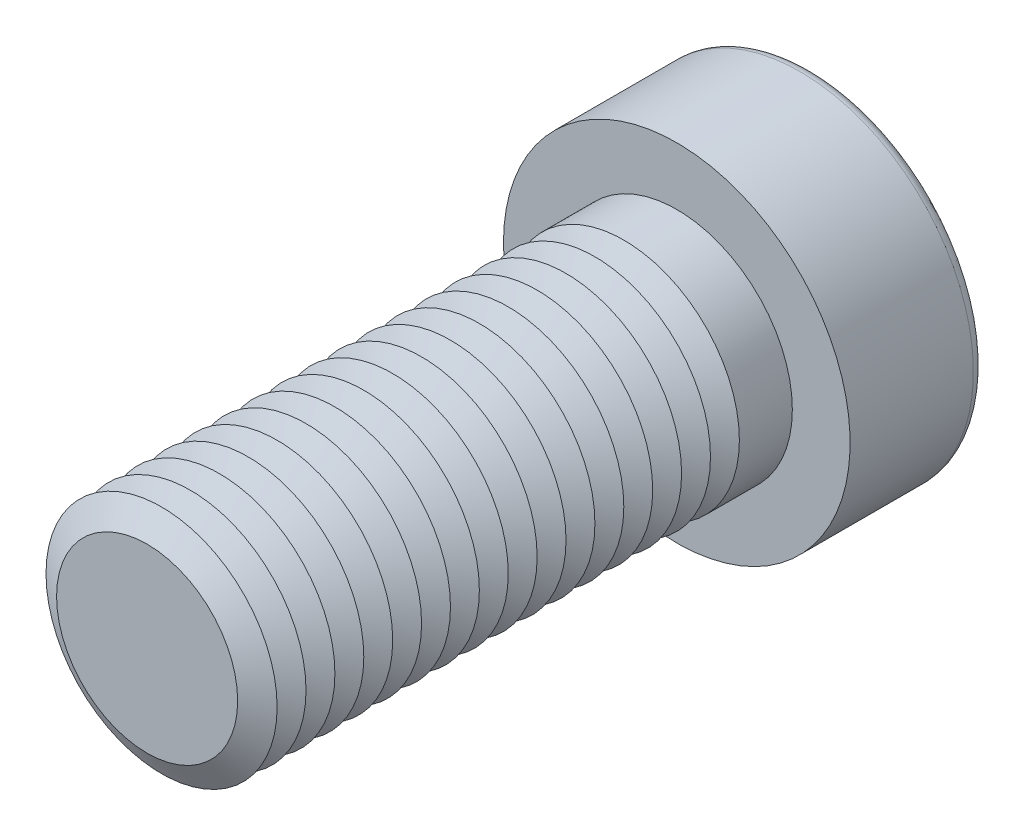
ISO-10303-21;
HEADER;
FILE_DESCRIPTION(('STEP AP214'),'2;1');
FILE_NAME('part.step','',(''),(''),'','','');
FILE_SCHEMA(('AUTOMOTIVE_DESIGN { 1 0 10303 214 1 1 1 1 }'));
ENDSEC;
DATA;
#1=APPLICATION_CONTEXT('core data for automotive mechanical design processes');
#2=APPLICATION_PROTOCOL_DEFINITION('international standard','automotive_design',2000,#1);
#3=PRODUCT_CONTEXT('',#1,'mechanical');
#4=PRODUCT('Part','Part','',(#3));
#5=PRODUCT_RELATED_PRODUCT_CATEGORY('part','',(#4));
#6=PRODUCT_DEFINITION_FORMATION('','',#4);
#7=PRODUCT_DEFINITION_CONTEXT('part definition',#1,'design');
#8=PRODUCT_DEFINITION('design','',#6,#7);
#9=PRODUCT_DEFINITION_SHAPE('','',#8);
#10=(LENGTH_UNIT() NAMED_UNIT(*) SI_UNIT(.MILLI.,.METRE.));
#11=(NAMED_UNIT(*) PLANE_ANGLE_UNIT() SI_UNIT($,.RADIAN.));
#12=(NAMED_UNIT(*) SI_UNIT($,.STERADIAN.) SOLID_ANGLE_UNIT());
#13=UNCERTAINTY_MEASURE_WITH_UNIT(LENGTH_MEASURE(1.E-05),#10,'distance_accuracy_value','');
#14=(GEOMETRIC_REPRESENTATION_CONTEXT(3) GLOBAL_UNCERTAINTY_ASSIGNED_CONTEXT((#13)) GLOBAL_UNIT_ASSIGNED_CONTEXT((#10,
#11,#12)) REPRESENTATION_CONTEXT('',''));
#15=CARTESIAN_POINT('',(0.,0.,0.));
#16=DIRECTION('',(0.,0.,1.));
#17=DIRECTION('',(1.,0.,0.));
#18=AXIS2_PLACEMENT_3D('',#15,#16,#17);
#19=CARTESIAN_POINT('',(0.,0.,44.5));
#20=DIRECTION('',(0.,0.,1.));
#21=DIRECTION('',(1.,0.,0.));
#22=AXIS2_PLACEMENT_3D('',#19,#20,#21);
#23=CONICAL_SURFACE('',#22,12.,1.0471975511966);
#24=CARTESIAN_POINT('',(0.,0.,43.));
#25=DIRECTION('',(0.,0.,1.));
#26=DIRECTION('',(1.,0.,0.));
#27=AXIS2_PLACEMENT_3D('',#24,#25,#26);
#28=CIRCLE('',#27,9.40192378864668);
#29=CARTESIAN_POINT('',(9.40192378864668,0.,43.));
#30=VERTEX_POINT('',#29);
#31=EDGE_CURVE('E314',#30,#30,#28,.T.);
#32=ORIENTED_EDGE('',*,*,#31,.T.);
#33=EDGE_LOOP('',(#32));
#34=FACE_BOUND('',#33,.T.);
#35=CARTESIAN_POINT('',(0.,0.,44.5));
#36=DIRECTION('',(0.,0.,1.));
#37=DIRECTION('',(1.,0.,0.));
#38=AXIS2_PLACEMENT_3D('',#35,#36,#37);
#39=CIRCLE('',#38,12.);
#40=CARTESIAN_POINT('',(12.,0.,44.5));
#41=VERTEX_POINT('',#40);
#42=EDGE_CURVE('E317',#41,#41,#39,.T.);
#43=ORIENTED_EDGE('',*,*,#42,.F.);
#44=EDGE_LOOP('',(#43));
#45=FACE_BOUND('',#44,.T.);
#46=ADVANCED_FACE('F39',(#34,#45),#23,.T.);
#47=CARTESIAN_POINT('',(0.,0.,43.));
#48=DIRECTION('',(0.,0.,-1.));
#49=DIRECTION('',(-1.,0.,0.));
#50=AXIS2_PLACEMENT_3D('',#47,#48,#49);
#51=CONICAL_SURFACE('',#50,9.40192378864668,1.0471975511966);
#52=CARTESIAN_POINT('',(0.,0.,41.5));
#53=DIRECTION('',(0.,0.,1.));
#54=DIRECTION('',(1.,0.,0.));
#55=AXIS2_PLACEMENT_3D('',#52,#53,#54);
#56=CIRCLE('',#55,12.);
#57=CARTESIAN_POINT('',(12.,0.,41.5));
#58=VERTEX_POINT('',#57);
#59=EDGE_CURVE('E324',#58,#58,#56,.T.);
#60=ORIENTED_EDGE('',*,*,#59,.T.);
#61=EDGE_LOOP('',(#60));
#62=FACE_BOUND('',#61,.T.);
#63=ORIENTED_EDGE('',*,*,#31,.F.);
#64=EDGE_LOOP('',(#63));
#65=FACE_BOUND('',#64,.T.);
#66=ADVANCED_FACE('F245',(#62,#65),#51,.T.);
#67=CARTESIAN_POINT('',(0.,0.,55.));
#68=DIRECTION('',(0.,0.,1.));
#69=DIRECTION('',(1.,0.,0.));
#70=AXIS2_PLACEMENT_3D('',#67,#68,#69);
#71=PLANE('',#70);
#72=CARTESIAN_POINT('',(0.,0.,55.));
#73=DIRECTION('',(0.,0.,1.));
#74=DIRECTION('',(1.,0.,0.));
#75=AXIS2_PLACEMENT_3D('',#72,#73,#74);
#76=CIRCLE('',#75,9.40192378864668);
#77=CARTESIAN_POINT('',(9.40192378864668,0.,55.));
#78=VERTEX_POINT('',#77);
#79=EDGE_CURVE('E174',#78,#78,#76,.T.);
#80=ORIENTED_EDGE('',*,*,#79,.T.);
#81=EDGE_LOOP('',(#80));
#82=FACE_BOUND('',#81,.T.);
#83=ADVANCED_FACE('F251',(#82),#71,.T.);
#84=CARTESIAN_POINT('',(0.,0.,55.));
#85=DIRECTION('',(0.,0.,-1.));
#86=DIRECTION('',(-1.,0.,0.));
#87=AXIS2_PLACEMENT_3D('',#84,#85,#86);
#88=CONICAL_SURFACE('',#87,9.40192378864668,1.0471975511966);
#89=CARTESIAN_POINT('',(0.,0.,53.5));
#90=DIRECTION('',(0.,0.,1.));
#91=DIRECTION('',(1.,0.,0.));
#92=AXIS2_PLACEMENT_3D('',#89,#90,#91);
#93=CIRCLE('',#92,12.);
#94=CARTESIAN_POINT('',(12.,0.,53.5));
#95=VERTEX_POINT('',#94);
#96=EDGE_CURVE('E291',#95,#95,#93,.T.);
#97=ORIENTED_EDGE('',*,*,#96,.T.);
#98=EDGE_LOOP('',(#97));
#99=FACE_BOUND('',#98,.T.);
#100=ORIENTED_EDGE('',*,*,#79,.F.);
#101=EDGE_LOOP('',(#100));
#102=FACE_BOUND('',#101,.T.);
#103=ADVANCED_FACE('F199',(#99,#102),#88,.T.);
#104=CARTESIAN_POINT('',(0.,0.,53.5));
#105=DIRECTION('',(0.,0.,1.));
#106=DIRECTION('',(1.,0.,0.));
#107=AXIS2_PLACEMENT_3D('',#104,#105,#106);
#108=CONICAL_SURFACE('',#107,12.,1.0471975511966);
#109=CARTESIAN_POINT('',(0.,0.,52.));
#110=DIRECTION('',(0.,0.,1.));
#111=DIRECTION('',(1.,0.,0.));
#112=AXIS2_PLACEMENT_3D('',#109,#110,#111);
#113=CIRCLE('',#112,9.40192378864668);
#114=CARTESIAN_POINT('',(9.40192378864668,0.,52.));
#115=VERTEX_POINT('',#114);
#116=EDGE_CURVE('E288',#115,#115,#113,.T.);
#117=ORIENTED_EDGE('',*,*,#116,.T.);
#118=EDGE_LOOP('',(#117));
#119=FACE_BOUND('',#118,.T.);
#120=ORIENTED_EDGE('',*,*,#96,.F.);
#121=EDGE_LOOP('',(#120));
#122=FACE_BOUND('',#121,.T.);
#123=ADVANCED_FACE('F277',(#119,#122),#108,.T.);
#124=CARTESIAN_POINT('',(0.,0.,52.));
#125=DIRECTION('',(0.,0.,-1.));
#126=DIRECTION('',(-1.,0.,0.));
#127=AXIS2_PLACEMENT_3D('',#124,#125,#126);
#128=CONICAL_SURFACE('',#127,9.40192378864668,1.0471975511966);
#129=CARTESIAN_POINT('',(0.,0.,50.5));
#130=DIRECTION('',(0.,0.,1.));
#131=DIRECTION('',(1.,0.,0.));
#132=AXIS2_PLACEMENT_3D('',#129,#130,#131);
#133=CIRCLE('',#132,12.);
#134=CARTESIAN_POINT('',(12.,0.,50.5));
#135=VERTEX_POINT('',#134);
#136=EDGE_CURVE('E300',#135,#135,#133,.T.);
#137=ORIENTED_EDGE('',*,*,#136,.T.);
#138=EDGE_LOOP('',(#137));
#139=FACE_BOUND('',#138,.T.);
#140=ORIENTED_EDGE('',*,*,#116,.F.);
#141=EDGE_LOOP('',(#140));
#142=FACE_BOUND('',#141,.T.);
#143=ADVANCED_FACE('F274',(#139,#142),#128,.T.);
#144=CARTESIAN_POINT('',(0.,0.,50.5));
#145=DIRECTION('',(0.,0.,1.));
#146=DIRECTION('',(1.,0.,0.));
#147=AXIS2_PLACEMENT_3D('',#144,#145,#146);
#148=CONICAL_SURFACE('',#147,12.,1.0471975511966);
#149=CARTESIAN_POINT('',(0.,0.,49.));
#150=DIRECTION('',(0.,0.,1.));
#151=DIRECTION('',(1.,0.,0.));
#152=AXIS2_PLACEMENT_3D('',#149,#150,#151);
#153=CIRCLE('',#152,9.40192378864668);
#154=CARTESIAN_POINT('',(9.40192378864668,0.,49.));
#155=VERTEX_POINT('',#154);
#156=EDGE_CURVE('E293',#155,#155,#153,.T.);
#157=ORIENTED_EDGE('',*,*,#156,.T.);
#158=EDGE_LOOP('',(#157));
#159=FACE_BOUND('',#158,.T.);
#160=ORIENTED_EDGE('',*,*,#136,.F.);
#161=EDGE_LOOP('',(#160));
#162=FACE_BOUND('',#161,.T.);
#163=ADVANCED_FACE('F270',(#159,#162),#148,.T.);
#164=CARTESIAN_POINT('',(0.,0.,49.));
#165=DIRECTION('',(0.,0.,-1.));
#166=DIRECTION('',(-1.,0.,0.));
#167=AXIS2_PLACEMENT_3D('',#164,#165,#166);
#168=CONICAL_SURFACE('',#167,9.40192378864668,1.0471975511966);
#169=CARTESIAN_POINT('',(0.,0.,47.5));
#170=DIRECTION('',(0.,0.,1.));
#171=DIRECTION('',(1.,0.,0.));
#172=AXIS2_PLACEMENT_3D('',#169,#170,#171);
#173=CIRCLE('',#172,12.);
#174=CARTESIAN_POINT('',(12.,0.,47.5));
#175=VERTEX_POINT('',#174);
#176=EDGE_CURVE('E310',#175,#175,#173,.T.);
#177=ORIENTED_EDGE('',*,*,#176,.T.);
#178=EDGE_LOOP('',(#177));
#179=FACE_BOUND('',#178,.T.);
#180=ORIENTED_EDGE('',*,*,#156,.F.);
#181=EDGE_LOOP('',(#180));
#182=FACE_BOUND('',#181,.T.);
#183=ADVANCED_FACE('F266',(#179,#182),#168,.T.);
#184=CARTESIAN_POINT('',(0.,0.,47.5));
#185=DIRECTION('',(0.,0.,1.));
#186=DIRECTION('',(1.,0.,0.));
#187=AXIS2_PLACEMENT_3D('',#184,#185,#186);
#188=CONICAL_SURFACE('',#187,12.,1.0471975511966);
#189=CARTESIAN_POINT('',(0.,0.,46.));
#190=DIRECTION('',(0.,0.,1.));
#191=DIRECTION('',(1.,0.,0.));
#192=AXIS2_PLACEMENT_3D('',#189,#190,#191);
#193=CIRCLE('',#192,9.40192378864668);
#194=CARTESIAN_POINT('',(9.40192378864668,0.,46.));
#195=VERTEX_POINT('',#194);
#196=EDGE_CURVE('E306',#195,#195,#193,.T.);
#197=ORIENTED_EDGE('',*,*,#196,.T.);
#198=EDGE_LOOP('',(#197));
#199=FACE_BOUND('',#198,.T.);
#200=ORIENTED_EDGE('',*,*,#176,.F.);
#201=EDGE_LOOP('',(#200));
#202=FACE_BOUND('',#201,.T.);
#203=ADVANCED_FACE('F262',(#199,#202),#188,.T.);
#204=CARTESIAN_POINT('',(0.,0.,46.));
#205=DIRECTION('',(0.,0.,-1.));
#206=DIRECTION('',(-1.,0.,0.));
#207=AXIS2_PLACEMENT_3D('',#204,#205,#206);
#208=CONICAL_SURFACE('',#207,9.40192378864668,1.0471975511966);
#209=ORIENTED_EDGE('',*,*,#42,.T.);
#210=EDGE_LOOP('',(#209));
#211=FACE_BOUND('',#210,.T.);
#212=ORIENTED_EDGE('',*,*,#196,.F.);
#213=EDGE_LOOP('',(#212));
#214=FACE_BOUND('',#213,.T.);
#215=ADVANCED_FACE('F258',(#211,#214),#208,.T.);
#216=CARTESIAN_POINT('',(0.,0.,41.5));
#217=DIRECTION('',(0.,0.,1.));
#218=DIRECTION('',(1.,0.,0.));
#219=AXIS2_PLACEMENT_3D('',#216,#217,#218);
#220=CONICAL_SURFACE('',#219,12.,1.0471975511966);
#221=CARTESIAN_POINT('',(0.,0.,40.));
#222=DIRECTION('',(0.,0.,1.));
#223=DIRECTION('',(1.,0.,0.));
#224=AXIS2_PLACEMENT_3D('',#221,#222,#223);
#225=CIRCLE('',#224,9.40192378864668);
#226=CARTESIAN_POINT('',(9.40192378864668,0.,40.));
#227=VERTEX_POINT('',#226);
#228=EDGE_CURVE('E321',#227,#227,#225,.T.);
#229=ORIENTED_EDGE('',*,*,#228,.T.);
#230=EDGE_LOOP('',(#229));
#231=FACE_BOUND('',#230,.T.);
#232=ORIENTED_EDGE('',*,*,#59,.F.);
#233=EDGE_LOOP('',(#232));
#234=FACE_BOUND('',#233,.T.);
#235=ADVANCED_FACE('F261',(#231,#234),#220,.T.);
#236=CARTESIAN_POINT('',(0.,0.,40.));
#237=DIRECTION('',(0.,0.,-1.));
#238=DIRECTION('',(-1.,0.,0.));
#239=AXIS2_PLACEMENT_3D('',#236,#237,#238);
#240=CONICAL_SURFACE('',#239,9.40192378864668,1.0471975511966);
#241=CARTESIAN_POINT('',(0.,0.,38.5));
#242=DIRECTION('',(0.,0.,1.));
#243=DIRECTION('',(1.,0.,0.));
#244=AXIS2_PLACEMENT_3D('',#241,#242,#243);
#245=CIRCLE('',#244,12.);
#246=CARTESIAN_POINT('',(12.,0.,38.5));
#247=VERTEX_POINT('',#246);
#248=EDGE_CURVE('E332',#247,#247,#245,.T.);
#249=ORIENTED_EDGE('',*,*,#248,.T.);
#250=EDGE_LOOP('',(#249));
#251=FACE_BOUND('',#250,.T.);
#252=ORIENTED_EDGE('',*,*,#228,.F.);
#253=EDGE_LOOP('',(#252));
#254=FACE_BOUND('',#253,.T.);
#255=ADVANCED_FACE('F512',(#251,#254),#240,.T.);
#256=CARTESIAN_POINT('',(0.,0.,38.5));
#257=DIRECTION('',(0.,0.,1.));
#258=DIRECTION('',(1.,0.,0.));
#259=AXIS2_PLACEMENT_3D('',#256,#257,#258);
#260=CONICAL_SURFACE('',#259,12.,1.0471975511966);
#261=CARTESIAN_POINT('',(0.,0.,37.));
#262=DIRECTION('',(0.,0.,1.));
#263=DIRECTION('',(1.,0.,0.));
#264=AXIS2_PLACEMENT_3D('',#261,#262,#263);
#265=CIRCLE('',#264,9.40192378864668);
#266=CARTESIAN_POINT('',(9.40192378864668,0.,37.));
#267=VERTEX_POINT('',#266);
#268=EDGE_CURVE('E328',#267,#267,#265,.T.);
#269=ORIENTED_EDGE('',*,*,#268,.T.);
#270=EDGE_LOOP('',(#269));
#271=FACE_BOUND('',#270,.T.);
#272=ORIENTED_EDGE('',*,*,#248,.F.);
#273=EDGE_LOOP('',(#272));
#274=FACE_BOUND('',#273,.T.);
#275=ADVANCED_FACE('F508',(#271,#274),#260,.T.);
#276=CARTESIAN_POINT('',(0.,0.,37.));
#277=DIRECTION('',(0.,0.,-1.));
#278=DIRECTION('',(-1.,0.,0.));
#279=AXIS2_PLACEMENT_3D('',#276,#277,#278);
#280=CONICAL_SURFACE('',#279,9.40192378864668,1.0471975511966);
#281=CARTESIAN_POINT('',(0.,0.,35.5));
#282=DIRECTION('',(0.,0.,1.));
#283=DIRECTION('',(1.,0.,0.));
#284=AXIS2_PLACEMENT_3D('',#281,#282,#283);
#285=CIRCLE('',#284,12.);
#286=CARTESIAN_POINT('',(12.,0.,35.5));
#287=VERTEX_POINT('',#286);
#288=EDGE_CURVE('E340',#287,#287,#285,.T.);
#289=ORIENTED_EDGE('',*,*,#288,.T.);
#290=EDGE_LOOP('',(#289));
#291=FACE_BOUND('',#290,.T.);
#292=ORIENTED_EDGE('',*,*,#268,.F.);
#293=EDGE_LOOP('',(#292));
#294=FACE_BOUND('',#293,.T.);
#295=ADVANCED_FACE('F504',(#291,#294),#280,.T.);
#296=CARTESIAN_POINT('',(0.,0.,35.5));
#297=DIRECTION('',(0.,0.,1.));
#298=DIRECTION('',(1.,0.,0.));
#299=AXIS2_PLACEMENT_3D('',#296,#297,#298);
#300=CONICAL_SURFACE('',#299,12.,1.0471975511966);
#301=CARTESIAN_POINT('',(0.,0.,34.));
#302=DIRECTION('',(0.,0.,1.));
#303=DIRECTION('',(1.,0.,0.));
#304=AXIS2_PLACEMENT_3D('',#301,#302,#303);
#305=CIRCLE('',#304,9.40192378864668);
#306=CARTESIAN_POINT('',(9.40192378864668,0.,34.));
#307=VERTEX_POINT('',#306);
#308=EDGE_CURVE('E336',#307,#307,#305,.T.);
#309=ORIENTED_EDGE('',*,*,#308,.T.);
#310=EDGE_LOOP('',(#309));
#311=FACE_BOUND('',#310,.T.);
#312=ORIENTED_EDGE('',*,*,#288,.F.);
#313=EDGE_LOOP('',(#312));
#314=FACE_BOUND('',#313,.T.);
#315=ADVANCED_FACE('F500',(#311,#314),#300,.T.);
#316=CARTESIAN_POINT('',(0.,0.,34.));
#317=DIRECTION('',(0.,0.,-1.));
#318=DIRECTION('',(-1.,0.,0.));
#319=AXIS2_PLACEMENT_3D('',#316,#317,#318);
#320=CONICAL_SURFACE('',#319,9.40192378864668,1.0471975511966);
#321=CARTESIAN_POINT('',(0.,0.,32.5));
#322=DIRECTION('',(0.,0.,1.));
#323=DIRECTION('',(1.,0.,0.));
#324=AXIS2_PLACEMENT_3D('',#321,#322,#323);
#325=CIRCLE('',#324,12.);
#326=CARTESIAN_POINT('',(12.,0.,32.5));
#327=VERTEX_POINT('',#326);
#328=EDGE_CURVE('E348',#327,#327,#325,.T.);
#329=ORIENTED_EDGE('',*,*,#328,.T.);
#330=EDGE_LOOP('',(#329));
#331=FACE_BOUND('',#330,.T.);
#332=ORIENTED_EDGE('',*,*,#308,.F.);
#333=EDGE_LOOP('',(#332));
#334=FACE_BOUND('',#333,.T.);
#335=ADVANCED_FACE('F496',(#331,#334),#320,.T.);
#336=CARTESIAN_POINT('',(0.,0.,32.5));
#337=DIRECTION('',(0.,0.,1.));
#338=DIRECTION('',(1.,0.,0.));
#339=AXIS2_PLACEMENT_3D('',#336,#337,#338);
#340=CONICAL_SURFACE('',#339,12.,1.0471975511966);
#341=CARTESIAN_POINT('',(0.,0.,31.));
#342=DIRECTION('',(0.,0.,1.));
#343=DIRECTION('',(1.,0.,0.));
#344=AXIS2_PLACEMENT_3D('',#341,#342,#343);
#345=CIRCLE('',#344,9.40192378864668);
#346=CARTESIAN_POINT('',(9.40192378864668,0.,31.));
#347=VERTEX_POINT('',#346);
#348=EDGE_CURVE('E344',#347,#347,#345,.T.);
#349=ORIENTED_EDGE('',*,*,#348,.T.);
#350=EDGE_LOOP('',(#349));
#351=FACE_BOUND('',#350,.T.);
#352=ORIENTED_EDGE('',*,*,#328,.F.);
#353=EDGE_LOOP('',(#352));
#354=FACE_BOUND('',#353,.T.);
#355=ADVANCED_FACE('F492',(#351,#354),#340,.T.);
#356=CARTESIAN_POINT('',(0.,0.,31.));
#357=DIRECTION('',(0.,0.,-1.));
#358=DIRECTION('',(-1.,0.,0.));
#359=AXIS2_PLACEMENT_3D('',#356,#357,#358);
#360=CONICAL_SURFACE('',#359,9.40192378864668,1.0471975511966);
#361=CARTESIAN_POINT('',(0.,0.,29.5));
#362=DIRECTION('',(0.,0.,1.));
#363=DIRECTION('',(1.,0.,0.));
#364=AXIS2_PLACEMENT_3D('',#361,#362,#363);
#365=CIRCLE('',#364,12.);
#366=CARTESIAN_POINT('',(12.,0.,29.5));
#367=VERTEX_POINT('',#366);
#368=EDGE_CURVE('E356',#367,#367,#365,.T.);
#369=ORIENTED_EDGE('',*,*,#368,.T.);
#370=EDGE_LOOP('',(#369));
#371=FACE_BOUND('',#370,.T.);
#372=ORIENTED_EDGE('',*,*,#348,.F.);
#373=EDGE_LOOP('',(#372));
#374=FACE_BOUND('',#373,.T.);
#375=ADVANCED_FACE('F488',(#371,#374),#360,.T.);
#376=CARTESIAN_POINT('',(0.,0.,29.5));
#377=DIRECTION('',(0.,0.,1.));
#378=DIRECTION('',(1.,0.,0.));
#379=AXIS2_PLACEMENT_3D('',#376,#377,#378);
#380=CONICAL_SURFACE('',#379,12.,1.0471975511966);
#381=CARTESIAN_POINT('',(0.,0.,28.));
#382=DIRECTION('',(0.,0.,1.));
#383=DIRECTION('',(1.,0.,0.));
#384=AXIS2_PLACEMENT_3D('',#381,#382,#383);
#385=CIRCLE('',#384,9.40192378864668);
#386=CARTESIAN_POINT('',(9.40192378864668,0.,28.));
#387=VERTEX_POINT('',#386);
#388=EDGE_CURVE('E352',#387,#387,#385,.T.);
#389=ORIENTED_EDGE('',*,*,#388,.T.);
#390=EDGE_LOOP('',(#389));
#391=FACE_BOUND('',#390,.T.);
#392=ORIENTED_EDGE('',*,*,#368,.F.);
#393=EDGE_LOOP('',(#392));
#394=FACE_BOUND('',#393,.T.);
#395=ADVANCED_FACE('F484',(#391,#394),#380,.T.);
#396=CARTESIAN_POINT('',(0.,0.,28.));
#397=DIRECTION('',(0.,0.,-1.));
#398=DIRECTION('',(-1.,0.,0.));
#399=AXIS2_PLACEMENT_3D('',#396,#397,#398);
#400=CONICAL_SURFACE('',#399,9.40192378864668,1.0471975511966);
#401=CARTESIAN_POINT('',(0.,0.,26.5));
#402=DIRECTION('',(0.,0.,1.));
#403=DIRECTION('',(1.,0.,0.));
#404=AXIS2_PLACEMENT_3D('',#401,#402,#403);
#405=CIRCLE('',#404,12.);
#406=CARTESIAN_POINT('',(12.,0.,26.5));
#407=VERTEX_POINT('',#406);
#408=EDGE_CURVE('E364',#407,#407,#405,.T.);
#409=ORIENTED_EDGE('',*,*,#408,.T.);
#410=EDGE_LOOP('',(#409));
#411=FACE_BOUND('',#410,.T.);
#412=ORIENTED_EDGE('',*,*,#388,.F.);
#413=EDGE_LOOP('',(#412));
#414=FACE_BOUND('',#413,.T.);
#415=ADVANCED_FACE('F480',(#411,#414),#400,.T.);
#416=CARTESIAN_POINT('',(0.,0.,26.5));
#417=DIRECTION('',(0.,0.,1.));
#418=DIRECTION('',(1.,0.,0.));
#419=AXIS2_PLACEMENT_3D('',#416,#417,#418);
#420=CONICAL_SURFACE('',#419,12.,1.0471975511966);
#421=CARTESIAN_POINT('',(0.,0.,25.));
#422=DIRECTION('',(0.,0.,1.));
#423=DIRECTION('',(1.,0.,0.));
#424=AXIS2_PLACEMENT_3D('',#421,#422,#423);
#425=CIRCLE('',#424,9.40192378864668);
#426=CARTESIAN_POINT('',(9.40192378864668,0.,25.));
#427=VERTEX_POINT('',#426);
#428=EDGE_CURVE('E360',#427,#427,#425,.T.);
#429=ORIENTED_EDGE('',*,*,#428,.T.);
#430=EDGE_LOOP('',(#429));
#431=FACE_BOUND('',#430,.T.);
#432=ORIENTED_EDGE('',*,*,#408,.F.);
#433=EDGE_LOOP('',(#432));
#434=FACE_BOUND('',#433,.T.);
#435=ADVANCED_FACE('F476',(#431,#434),#420,.T.);
#436=CARTESIAN_POINT('',(0.,0.,25.));
#437=DIRECTION('',(0.,0.,-1.));
#438=DIRECTION('',(-1.,0.,0.));
#439=AXIS2_PLACEMENT_3D('',#436,#437,#438);
#440=CONICAL_SURFACE('',#439,9.40192378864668,1.0471975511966);
#441=CARTESIAN_POINT('',(0.,0.,23.5));
#442=DIRECTION('',(0.,0.,1.));
#443=DIRECTION('',(1.,0.,0.));
#444=AXIS2_PLACEMENT_3D('',#441,#442,#443);
#445=CIRCLE('',#444,12.);
#446=CARTESIAN_POINT('',(12.,0.,23.5));
#447=VERTEX_POINT('',#446);
#448=EDGE_CURVE('E372',#447,#447,#445,.T.);
#449=ORIENTED_EDGE('',*,*,#448,.T.);
#450=EDGE_LOOP('',(#449));
#451=FACE_BOUND('',#450,.T.);
#452=ORIENTED_EDGE('',*,*,#428,.F.);
#453=EDGE_LOOP('',(#452));
#454=FACE_BOUND('',#453,.T.);
#455=ADVANCED_FACE('F472',(#451,#454),#440,.T.);
#456=CARTESIAN_POINT('',(0.,0.,23.5));
#457=DIRECTION('',(0.,0.,1.));
#458=DIRECTION('',(1.,0.,0.));
#459=AXIS2_PLACEMENT_3D('',#456,#457,#458);
#460=CONICAL_SURFACE('',#459,12.,1.0471975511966);
#461=CARTESIAN_POINT('',(0.,0.,22.));
#462=DIRECTION('',(0.,0.,1.));
#463=DIRECTION('',(1.,0.,0.));
#464=AXIS2_PLACEMENT_3D('',#461,#462,#463);
#465=CIRCLE('',#464,9.40192378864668);
#466=CARTESIAN_POINT('',(9.40192378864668,0.,22.));
#467=VERTEX_POINT('',#466);
#468=EDGE_CURVE('E368',#467,#467,#465,.T.);
#469=ORIENTED_EDGE('',*,*,#468,.T.);
#470=EDGE_LOOP('',(#469));
#471=FACE_BOUND('',#470,.T.);
#472=ORIENTED_EDGE('',*,*,#448,.F.);
#473=EDGE_LOOP('',(#472));
#474=FACE_BOUND('',#473,.T.);
#475=ADVANCED_FACE('F468',(#471,#474),#460,.T.);
#476=CARTESIAN_POINT('',(0.,0.,22.));
#477=DIRECTION('',(0.,0.,-1.));
#478=DIRECTION('',(-1.,0.,0.));
#479=AXIS2_PLACEMENT_3D('',#476,#477,#478);
#480=CONICAL_SURFACE('',#479,9.40192378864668,1.0471975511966);
#481=CARTESIAN_POINT('',(0.,0.,20.5));
#482=DIRECTION('',(0.,0.,1.));
#483=DIRECTION('',(1.,0.,0.));
#484=AXIS2_PLACEMENT_3D('',#481,#482,#483);
#485=CIRCLE('',#484,12.);
#486=CARTESIAN_POINT('',(12.,0.,20.5));
#487=VERTEX_POINT('',#486);
#488=EDGE_CURVE('E380',#487,#487,#485,.T.);
#489=ORIENTED_EDGE('',*,*,#488,.T.);
#490=EDGE_LOOP('',(#489));
#491=FACE_BOUND('',#490,.T.);
#492=ORIENTED_EDGE('',*,*,#468,.F.);
#493=EDGE_LOOP('',(#492));
#494=FACE_BOUND('',#493,.T.);
#495=ADVANCED_FACE('F464',(#491,#494),#480,.T.);
#496=CARTESIAN_POINT('',(0.,0.,20.5));
#497=DIRECTION('',(0.,0.,1.));
#498=DIRECTION('',(1.,0.,0.));
#499=AXIS2_PLACEMENT_3D('',#496,#497,#498);
#500=CONICAL_SURFACE('',#499,12.,1.0471975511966);
#501=CARTESIAN_POINT('',(0.,0.,19.));
#502=DIRECTION('',(0.,0.,1.));
#503=DIRECTION('',(1.,0.,0.));
#504=AXIS2_PLACEMENT_3D('',#501,#502,#503);
#505=CIRCLE('',#504,9.40192378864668);
#506=CARTESIAN_POINT('',(9.40192378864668,0.,19.));
#507=VERTEX_POINT('',#506);
#508=EDGE_CURVE('E376',#507,#507,#505,.T.);
#509=ORIENTED_EDGE('',*,*,#508,.T.);
#510=EDGE_LOOP('',(#509));
#511=FACE_BOUND('',#510,.T.);
#512=ORIENTED_EDGE('',*,*,#488,.F.);
#513=EDGE_LOOP('',(#512));
#514=FACE_BOUND('',#513,.T.);
#515=ADVANCED_FACE('F460',(#511,#514),#500,.T.);
#516=CARTESIAN_POINT('',(0.,0.,19.));
#517=DIRECTION('',(0.,0.,-1.));
#518=DIRECTION('',(-1.,0.,0.));
#519=AXIS2_PLACEMENT_3D('',#516,#517,#518);
#520=CONICAL_SURFACE('',#519,9.40192378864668,1.0471975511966);
#521=CARTESIAN_POINT('',(0.,0.,17.5));
#522=DIRECTION('',(0.,0.,1.));
#523=DIRECTION('',(1.,0.,0.));
#524=AXIS2_PLACEMENT_3D('',#521,#522,#523);
#525=CIRCLE('',#524,12.);
#526=CARTESIAN_POINT('',(12.,0.,17.5));
#527=VERTEX_POINT('',#526);
#528=EDGE_CURVE('E388',#527,#527,#525,.T.);
#529=ORIENTED_EDGE('',*,*,#528,.T.);
#530=EDGE_LOOP('',(#529));
#531=FACE_BOUND('',#530,.T.);
#532=ORIENTED_EDGE('',*,*,#508,.F.);
#533=EDGE_LOOP('',(#532));
#534=FACE_BOUND('',#533,.T.);
#535=ADVANCED_FACE('F456',(#531,#534),#520,.T.);
#536=CARTESIAN_POINT('',(0.,0.,17.5));
#537=DIRECTION('',(0.,0.,1.));
#538=DIRECTION('',(1.,0.,0.));
#539=AXIS2_PLACEMENT_3D('',#536,#537,#538);
#540=CONICAL_SURFACE('',#539,12.,1.0471975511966);
#541=CARTESIAN_POINT('',(0.,0.,16.));
#542=DIRECTION('',(0.,0.,1.));
#543=DIRECTION('',(1.,0.,0.));
#544=AXIS2_PLACEMENT_3D('',#541,#542,#543);
#545=CIRCLE('',#544,9.40192378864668);
#546=CARTESIAN_POINT('',(9.40192378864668,0.,16.));
#547=VERTEX_POINT('',#546);
#548=EDGE_CURVE('E384',#547,#547,#545,.T.);
#549=ORIENTED_EDGE('',*,*,#548,.T.);
#550=EDGE_LOOP('',(#549));
#551=FACE_BOUND('',#550,.T.);
#552=ORIENTED_EDGE('',*,*,#528,.F.);
#553=EDGE_LOOP('',(#552));
#554=FACE_BOUND('',#553,.T.);
#555=ADVANCED_FACE('F452',(#551,#554),#540,.T.);
#556=CARTESIAN_POINT('',(0.,0.,16.));
#557=DIRECTION('',(0.,0.,-1.));
#558=DIRECTION('',(-1.,0.,0.));
#559=AXIS2_PLACEMENT_3D('',#556,#557,#558);
#560=CONICAL_SURFACE('',#559,9.40192378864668,1.0471975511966);
#561=CARTESIAN_POINT('',(0.,0.,14.5));
#562=DIRECTION('',(0.,0.,1.));
#563=DIRECTION('',(1.,0.,0.));
#564=AXIS2_PLACEMENT_3D('',#561,#562,#563);
#565=CIRCLE('',#564,12.);
#566=CARTESIAN_POINT('',(12.,0.,14.5));
#567=VERTEX_POINT('',#566);
#568=EDGE_CURVE('E396',#567,#567,#565,.T.);
#569=ORIENTED_EDGE('',*,*,#568,.T.);
#570=EDGE_LOOP('',(#569));
#571=FACE_BOUND('',#570,.T.);
#572=ORIENTED_EDGE('',*,*,#548,.F.);
#573=EDGE_LOOP('',(#572));
#574=FACE_BOUND('',#573,.T.);
#575=ADVANCED_FACE('F448',(#571,#574),#560,.T.);
#576=CARTESIAN_POINT('',(0.,0.,14.5));
#577=DIRECTION('',(0.,0.,1.));
#578=DIRECTION('',(1.,0.,0.));
#579=AXIS2_PLACEMENT_3D('',#576,#577,#578);
#580=CONICAL_SURFACE('',#579,12.,1.0471975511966);
#581=CARTESIAN_POINT('',(0.,0.,13.));
#582=DIRECTION('',(0.,0.,1.));
#583=DIRECTION('',(1.,0.,0.));
#584=AXIS2_PLACEMENT_3D('',#581,#582,#583);
#585=CIRCLE('',#584,9.40192378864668);
#586=CARTESIAN_POINT('',(9.40192378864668,0.,13.));
#587=VERTEX_POINT('',#586);
#588=EDGE_CURVE('E392',#587,#587,#585,.T.);
#589=ORIENTED_EDGE('',*,*,#588,.T.);
#590=EDGE_LOOP('',(#589));
#591=FACE_BOUND('',#590,.T.);
#592=ORIENTED_EDGE('',*,*,#568,.F.);
#593=EDGE_LOOP('',(#592));
#594=FACE_BOUND('',#593,.T.);
#595=ADVANCED_FACE('F444',(#591,#594),#580,.T.);
#596=CARTESIAN_POINT('',(0.,0.,13.));
#597=DIRECTION('',(0.,0.,-1.));
#598=DIRECTION('',(-1.,0.,0.));
#599=AXIS2_PLACEMENT_3D('',#596,#597,#598);
#600=CONICAL_SURFACE('',#599,9.40192378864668,1.0471975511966);
#601=CARTESIAN_POINT('',(0.,0.,11.5));
#602=DIRECTION('',(0.,0.,1.));
#603=DIRECTION('',(1.,0.,0.));
#604=AXIS2_PLACEMENT_3D('',#601,#602,#603);
#605=CIRCLE('',#604,12.);
#606=CARTESIAN_POINT('',(12.,0.,11.5));
#607=VERTEX_POINT('',#606);
#608=EDGE_CURVE('E403',#607,#607,#605,.T.);
#609=ORIENTED_EDGE('',*,*,#608,.T.);
#610=EDGE_LOOP('',(#609));
#611=FACE_BOUND('',#610,.T.);
#612=ORIENTED_EDGE('',*,*,#588,.F.);
#613=EDGE_LOOP('',(#612));
#614=FACE_BOUND('',#613,.T.);
#615=ADVANCED_FACE('F440',(#611,#614),#600,.T.);
#616=CARTESIAN_POINT('',(0.,0.,11.5));
#617=DIRECTION('',(0.,0.,1.));
#618=DIRECTION('',(1.,0.,0.));
#619=AXIS2_PLACEMENT_3D('',#616,#617,#618);
#620=CONICAL_SURFACE('',#619,12.,1.0471975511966);
#621=CARTESIAN_POINT('',(0.,0.,10.));
#622=DIRECTION('',(0.,0.,1.));
#623=DIRECTION('',(1.,0.,0.));
#624=AXIS2_PLACEMENT_3D('',#621,#622,#623);
#625=CIRCLE('',#624,9.40192378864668);
#626=CARTESIAN_POINT('',(9.40192378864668,0.,10.));
#627=VERTEX_POINT('',#626);
#628=EDGE_CURVE('E399',#627,#627,#625,.T.);
#629=ORIENTED_EDGE('',*,*,#628,.T.);
#630=EDGE_LOOP('',(#629));
#631=FACE_BOUND('',#630,.T.);
#632=ORIENTED_EDGE('',*,*,#608,.F.);
#633=EDGE_LOOP('',(#632));
#634=FACE_BOUND('',#633,.T.);
#635=ADVANCED_FACE('F435',(#631,#634),#620,.T.);
#636=CARTESIAN_POINT('',(0.,0.,10.));
#637=DIRECTION('',(0.,0.,-1.));
#638=DIRECTION('',(-1.,0.,0.));
#639=AXIS2_PLACEMENT_3D('',#636,#637,#638);
#640=CONICAL_SURFACE('',#639,9.40192378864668,1.0471975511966);
#641=CARTESIAN_POINT('',(0.,0.,8.5));
#642=DIRECTION('',(0.,0.,1.));
#643=DIRECTION('',(1.,0.,0.));
#644=AXIS2_PLACEMENT_3D('',#641,#642,#643);
#645=CIRCLE('',#644,12.);
#646=CARTESIAN_POINT('',(12.,0.,8.5));
#647=VERTEX_POINT('',#646);
#648=EDGE_CURVE('E415',#647,#647,#645,.T.);
#649=ORIENTED_EDGE('',*,*,#648,.T.);
#650=EDGE_LOOP('',(#649));
#651=FACE_BOUND('',#650,.T.);
#652=ORIENTED_EDGE('',*,*,#628,.F.);
#653=EDGE_LOOP('',(#652));
#654=FACE_BOUND('',#653,.T.);
#655=ADVANCED_FACE('F421',(#651,#654),#640,.T.);
#656=CARTESIAN_POINT('',(0.,0.,8.5));
#657=DIRECTION('',(0.,0.,1.));
#658=DIRECTION('',(1.,0.,0.));
#659=AXIS2_PLACEMENT_3D('',#656,#657,#658);
#660=CONICAL_SURFACE('',#659,12.,1.0471975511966);
#661=CARTESIAN_POINT('',(0.,0.,7.));
#662=DIRECTION('',(0.,0.,1.));
#663=DIRECTION('',(1.,0.,0.));
#664=AXIS2_PLACEMENT_3D('',#661,#662,#663);
#665=CIRCLE('',#664,9.40192378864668);
#666=CARTESIAN_POINT('',(9.40192378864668,0.,7.));
#667=VERTEX_POINT('',#666);
#668=EDGE_CURVE('E407',#667,#667,#665,.T.);
#669=ORIENTED_EDGE('',*,*,#668,.T.);
#670=EDGE_LOOP('',(#669));
#671=FACE_BOUND('',#670,.T.);
#672=ORIENTED_EDGE('',*,*,#648,.F.);
#673=EDGE_LOOP('',(#672));
#674=FACE_BOUND('',#673,.T.);
#675=ADVANCED_FACE('F424',(#671,#674),#660,.T.);
#676=CARTESIAN_POINT('',(0.,0.,7.));
#677=DIRECTION('',(0.,0.,-1.));
#678=DIRECTION('',(-1.,0.,0.));
#679=AXIS2_PLACEMENT_3D('',#676,#677,#678);
#680=CONICAL_SURFACE('',#679,9.40192378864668,1.0471975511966);
#681=CARTESIAN_POINT('',(0.,0.,5.5));
#682=DIRECTION('',(0.,0.,1.));
#683=DIRECTION('',(1.,0.,0.));
#684=AXIS2_PLACEMENT_3D('',#681,#682,#683);
#685=CIRCLE('',#684,12.);
#686=CARTESIAN_POINT('',(12.,0.,5.5));
#687=VERTEX_POINT('',#686);
#688=EDGE_CURVE('E411',#687,#687,#685,.T.);
#689=ORIENTED_EDGE('',*,*,#688,.T.);
#690=EDGE_LOOP('',(#689));
#691=FACE_BOUND('',#690,.T.);
#692=ORIENTED_EDGE('',*,*,#668,.F.);
#693=EDGE_LOOP('',(#692));
#694=FACE_BOUND('',#693,.T.);
#695=ADVANCED_FACE('F426',(#691,#694),#680,.T.);
#696=CARTESIAN_POINT('',(0.,0.,0.25));
#697=DIRECTION('',(0.,0.,-1.));
#698=DIRECTION('',(-1.,0.,0.));
#699=AXIS2_PLACEMENT_3D('',#696,#697,#698);
#700=CONICAL_SURFACE('',#699,9.5,1.0471975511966);
#701=CARTESIAN_POINT('',(0.,0.,5.73482755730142));
#702=VERTEX_POINT('',#701);
#703=VERTEX_LOOP('',#702);
#704=FACE_BOUND('',#703,.T.);
#705=CARTESIAN_POINT('',(0.,0.,0.25));
#706=DIRECTION('',(0.,0.,-1.));
#707=DIRECTION('',(-1.,0.,0.));
#708=AXIS2_PLACEMENT_3D('',#705,#706,#707);
#709=CIRCLE('',#708,9.5);
#710=CARTESIAN_POINT('',(-8.22724133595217,4.75,0.25));
#711=VERTEX_POINT('',#710);
#712=CARTESIAN_POINT('',(0.,9.5,0.25));
#713=VERTEX_POINT('',#712);
#714=EDGE_CURVE('E149',#711,#713,#709,.T.);
#715=ORIENTED_EDGE('',*,*,#714,.T.);
#716=CARTESIAN_POINT('',(0.,0.,0.25));
#717=DIRECTION('',(0.,0.,-1.));
#718=DIRECTION('',(-1.,0.,0.));
#719=AXIS2_PLACEMENT_3D('',#716,#717,#718);
#720=CIRCLE('',#719,9.5);
#721=CARTESIAN_POINT('',(8.22724133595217,4.75,0.25));
#722=VERTEX_POINT('',#721);
#723=EDGE_CURVE('E54',#713,#722,#720,.T.);
#724=ORIENTED_EDGE('',*,*,#723,.T.);
#725=CARTESIAN_POINT('',(8.22724133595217,-4.75,0.25));
#726=VERTEX_POINT('',#725);
#727=EDGE_CURVE('E1027',#722,#726,#720,.T.);
#728=ORIENTED_EDGE('',*,*,#727,.T.);
#729=CARTESIAN_POINT('',(0.,-9.5,0.25));
#730=VERTEX_POINT('',#729);
#731=EDGE_CURVE('E1025',#726,#730,#720,.T.);
#732=ORIENTED_EDGE('',*,*,#731,.T.);
#733=CARTESIAN_POINT('',(-8.22724133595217,-4.75,0.25));
#734=VERTEX_POINT('',#733);
#735=EDGE_CURVE('E1021',#730,#734,#720,.T.);
#736=ORIENTED_EDGE('',*,*,#735,.T.);
#737=EDGE_CURVE('E1019',#734,#711,#720,.T.);
#738=ORIENTED_EDGE('',*,*,#737,.T.);
#739=EDGE_LOOP('',(#715,#724,#728,#732,#736,#738));
#740=FACE_BOUND('',#739,.T.);
#741=ADVANCED_FACE('F201',(#704,#740),#700,.F.);
#742=CARTESIAN_POINT('',(0.,0.,0.25));
#743=DIRECTION('',(0.,0.,-1.));
#744=DIRECTION('',(-1.,0.,0.));
#745=AXIS2_PLACEMENT_3D('',#742,#743,#744);
#746=PLANE('',#745);
#747=ORIENTED_EDGE('',*,*,#723,.F.);
#748=DIRECTION('',(1.,0.,0.));
#749=VECTOR('',#748,1.);
#750=CARTESIAN_POINT('',(-5.48482755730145,9.5,0.25));
#751=LINE('',#750,#749);
#752=CARTESIAN_POINT('',(5.48482755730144,9.5,0.25));
#753=VERTEX_POINT('',#752);
#754=EDGE_CURVE('E1067',#713,#753,#751,.T.);
#755=ORIENTED_EDGE('',*,*,#754,.T.);
#756=DIRECTION('',(0.5,-0.866025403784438,0.));
#757=VECTOR('',#756,1.);
#758=CARTESIAN_POINT('',(5.48482755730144,9.5,0.25));
#759=LINE('',#758,#757);
#760=EDGE_CURVE('E155',#753,#722,#759,.T.);
#761=ORIENTED_EDGE('',*,*,#760,.T.);
#762=EDGE_LOOP('',(#747,#755,#761));
#763=FACE_BOUND('',#762,.T.);
#764=ADVANCED_FACE('F607',(#763),#746,.T.);
#765=ORIENTED_EDGE('',*,*,#727,.F.);
#766=CARTESIAN_POINT('',(10.9696551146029,0.,0.25));
#767=VERTEX_POINT('',#766);
#768=EDGE_CURVE('E1065',#722,#767,#759,.T.);
#769=ORIENTED_EDGE('',*,*,#768,.T.);
#770=DIRECTION('',(-0.5,-0.866025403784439,0.));
#771=VECTOR('',#770,1.);
#772=CARTESIAN_POINT('',(10.9696551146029,0.,0.25));
#773=LINE('',#772,#771);
#774=EDGE_CURVE('E1040',#767,#726,#773,.T.);
#775=ORIENTED_EDGE('',*,*,#774,.T.);
#776=EDGE_LOOP('',(#765,#769,#775));
#777=FACE_BOUND('',#776,.T.);
#778=ADVANCED_FACE('F617',(#777),#746,.T.);
#779=ORIENTED_EDGE('',*,*,#731,.F.);
#780=CARTESIAN_POINT('',(5.48482755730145,-9.5,0.25));
#781=VERTEX_POINT('',#780);
#782=EDGE_CURVE('E1042',#726,#781,#773,.T.);
#783=ORIENTED_EDGE('',*,*,#782,.T.);
#784=DIRECTION('',(-1.,0.,0.));
#785=VECTOR('',#784,1.);
#786=CARTESIAN_POINT('',(5.48482755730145,-9.5,0.25));
#787=LINE('',#786,#785);
#788=EDGE_CURVE('E993',#781,#730,#787,.T.);
#789=ORIENTED_EDGE('',*,*,#788,.T.);
#790=EDGE_LOOP('',(#779,#783,#789));
#791=FACE_BOUND('',#790,.T.);
#792=ADVANCED_FACE('F627',(#791),#746,.T.);
#793=ORIENTED_EDGE('',*,*,#735,.F.);
#794=CARTESIAN_POINT('',(-5.48482755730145,-9.5,0.25));
#795=VERTEX_POINT('',#794);
#796=EDGE_CURVE('E1036',#730,#795,#787,.T.);
#797=ORIENTED_EDGE('',*,*,#796,.T.);
#798=DIRECTION('',(-0.5,0.866025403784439,0.));
#799=VECTOR('',#798,1.);
#800=CARTESIAN_POINT('',(-5.48482755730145,-9.5,0.25));
#801=LINE('',#800,#799);
#802=EDGE_CURVE('E1038',#795,#734,#801,.T.);
#803=ORIENTED_EDGE('',*,*,#802,.T.);
#804=EDGE_LOOP('',(#793,#797,#803));
#805=FACE_BOUND('',#804,.T.);
#806=ADVANCED_FACE('F635',(#805),#746,.T.);
#807=ORIENTED_EDGE('',*,*,#737,.F.);
#808=CARTESIAN_POINT('',(-10.9696551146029,0.,0.25));
#809=VERTEX_POINT('',#808);
#810=EDGE_CURVE('E1044',#734,#809,#801,.T.);
#811=ORIENTED_EDGE('',*,*,#810,.T.);
#812=DIRECTION('',(0.5,0.866025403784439,0.));
#813=VECTOR('',#812,1.);
#814=CARTESIAN_POINT('',(-10.9696551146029,0.,0.25));
#815=LINE('',#814,#813);
#816=EDGE_CURVE('E158',#809,#711,#815,.T.);
#817=ORIENTED_EDGE('',*,*,#816,.T.);
#818=EDGE_LOOP('',(#807,#811,#817));
#819=FACE_BOUND('',#818,.T.);
#820=ADVANCED_FACE('F231',(#819),#746,.T.);
#821=ORIENTED_EDGE('',*,*,#714,.F.);
#822=CARTESIAN_POINT('',(-5.48482755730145,9.5,0.25));
#823=VERTEX_POINT('',#822);
#824=EDGE_CURVE('E1050',#711,#823,#815,.T.);
#825=ORIENTED_EDGE('',*,*,#824,.T.);
#826=EDGE_CURVE('E1066',#823,#713,#751,.T.);
#827=ORIENTED_EDGE('',*,*,#826,.T.);
#828=EDGE_LOOP('',(#821,#825,#827));
#829=FACE_BOUND('',#828,.T.);
#830=ADVANCED_FACE('F619',(#829),#746,.T.);
#831=CARTESIAN_POINT('',(-5.48482755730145,9.5,0.25));
#832=DIRECTION('',(0.,1.,0.));
#833=DIRECTION('',(0.,0.,1.));
#834=AXIS2_PLACEMENT_3D('',#831,#832,#833);
#835=PLANE('',#834);
#836=DIRECTION('',(0.,0.,-1.));
#837=VECTOR('',#836,1.);
#838=CARTESIAN_POINT('',(-5.48482755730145,9.5,0.25));
#839=LINE('',#838,#837);
#840=CARTESIAN_POINT('',(-5.48482755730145,9.5,-14.));
#841=VERTEX_POINT('',#840);
#842=EDGE_CURVE('E147',#823,#841,#839,.T.);
#843=ORIENTED_EDGE('',*,*,#842,.T.);
#844=CARTESIAN_POINT('',(-14.3184360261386,9.5,-15.6649552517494));
#845=CARTESIAN_POINT('',(-13.8894653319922,9.5,-15.5692031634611));
#846=CARTESIAN_POINT('',(-13.460220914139,9.5,-15.4746548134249));
#847=CARTESIAN_POINT('',(-12.6010505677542,9.5,-15.2886152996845));
#848=CARTESIAN_POINT('',(-12.1711246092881,9.5,-15.1971242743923));
#849=CARTESIAN_POINT('',(-11.3100507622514,9.5,-15.0177651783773));
#850=CARTESIAN_POINT('',(-10.8789020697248,9.5,-14.9299009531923));
#851=CARTESIAN_POINT('',(-10.0156929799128,9.5,-14.7587741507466));
#852=CARTESIAN_POINT('',(-9.5836325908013,9.5,-14.67551153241));
#853=CARTESIAN_POINT('',(-8.72220045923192,9.5,-14.5153788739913));
#854=CARTESIAN_POINT('',(-8.29283790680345,9.5,-14.4384596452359));
#855=CARTESIAN_POINT('',(-7.43292010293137,9.5,-14.2915458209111));
#856=CARTESIAN_POINT('',(-7.0023648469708,9.5,-14.2215512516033));
#857=CARTESIAN_POINT('',(-6.14001360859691,9.5,-14.0901048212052));
#858=CARTESIAN_POINT('',(-5.70821784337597,9.5,-14.0286515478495));
#859=CARTESIAN_POINT('',(-4.84325961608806,9.5,-13.9161318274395));
#860=CARTESIAN_POINT('',(-4.41009715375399,9.5,-13.8650653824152));
#861=CARTESIAN_POINT('',(-3.53757113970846,9.5,-13.7748018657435));
#862=CARTESIAN_POINT('',(-3.09819281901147,9.5,-13.7357454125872));
#863=CARTESIAN_POINT('',(-2.2183738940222,9.5,-13.6722240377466));
#864=CARTESIAN_POINT('',(-1.77793331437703,9.5,-13.6477587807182));
#865=CARTESIAN_POINT('',(-0.896631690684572,9.5,-13.6148480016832));
#866=CARTESIAN_POINT('',(-0.455770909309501,9.5,-13.606395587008));
#867=CARTESIAN_POINT('',(0.425958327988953,9.5,-13.606024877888));
#868=CARTESIAN_POINT('',(0.866826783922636,9.5,-13.614106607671));
#869=CARTESIAN_POINT('',(1.74977048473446,9.5,-13.6463580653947));
#870=CARTESIAN_POINT('',(2.1918432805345,9.5,-13.6705935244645));
#871=CARTESIAN_POINT('',(3.07492453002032,9.5,-13.7337958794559));
#872=CARTESIAN_POINT('',(3.5159329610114,9.5,-13.7727630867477));
#873=CARTESIAN_POINT('',(4.39689734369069,9.5,-13.8635087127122));
#874=CARTESIAN_POINT('',(4.83685243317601,9.5,-13.9152953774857));
#875=CARTESIAN_POINT('',(5.71535222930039,9.5,-14.0295826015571));
#876=CARTESIAN_POINT('',(6.15389693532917,9.5,-14.0920831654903));
#877=CARTESIAN_POINT('',(7.04109045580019,9.5,-14.2276023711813));
#878=CARTESIAN_POINT('',(7.48970345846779,9.5,-14.3008534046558));
#879=CARTESIAN_POINT('',(8.38565999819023,9.5,-14.4547834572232));
#880=CARTESIAN_POINT('',(8.83300349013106,9.5,-14.5354627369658));
#881=CARTESIAN_POINT('',(9.72662836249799,9.5,-14.7027801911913));
#882=CARTESIAN_POINT('',(10.1729095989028,9.5,-14.7894191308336));
#883=CARTESIAN_POINT('',(11.0645098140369,9.5,-14.9674686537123));
#884=CARTESIAN_POINT('',(11.5098288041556,9.5,-15.0588791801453));
#885=CARTESIAN_POINT('',(12.3998049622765,9.5,-15.2455765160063));
#886=CARTESIAN_POINT('',(12.8444618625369,9.5,-15.3408645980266));
#887=CARTESIAN_POINT('',(13.7330947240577,9.5,-15.5345693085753));
#888=CARTESIAN_POINT('',(14.1770706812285,9.5,-15.6329859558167));
#889=CARTESIAN_POINT('',(15.5080689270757,9.5,-15.9320263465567));
#890=CARTESIAN_POINT('',(16.3942355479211,9.5,-16.1364562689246));
#891=CARTESIAN_POINT('',(18.1541693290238,9.5,-16.5497091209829));
#892=CARTESIAN_POINT('',(19.0279562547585,9.5,-16.7584484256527));
#893=CARTESIAN_POINT('',(20.7743818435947,9.5,-17.180754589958));
#894=CARTESIAN_POINT('',(21.647020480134,9.5,-17.3943215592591));
#895=CARTESIAN_POINT('',(23.3902098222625,9.5,-17.8246823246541));
#896=CARTESIAN_POINT('',(24.2607617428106,9.5,-18.0414712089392));
#897=CARTESIAN_POINT('',(25.5660757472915,9.5,-18.3686360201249));
#898=CARTESIAN_POINT('',(26.0010870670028,9.5,-18.4780192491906));
#899=CARTESIAN_POINT('',(26.8709622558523,9.5,-18.6973688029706));
#900=CARTESIAN_POINT('',(27.3058261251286,9.5,-18.8073351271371));
#901=CARTESIAN_POINT('',(27.7406260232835,9.5,-18.9175537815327));
#902=B_SPLINE_CURVE_WITH_KNOTS('',3,(#844,#845,#846,#847,#848,#849,#850,#851,#852,#853,#854,
#855,#856,#857,#858,#859,#860,#861,#862,#863,#864,#865,#866,#867,#868,#869,#870,#871,#872,#873,
#874,#875,#876,#877,#878,#879,#880,#881,#882,#883,#884,#885,#886,#887,#888,#889,#890,#891,#892,
#893,#894,#895,#896,#897,#898,#899,#900,#901),.UNSPECIFIED.,.F.,.F.,(4,2,2,2,2,2,2,2,2,2,2,2,2,
2,2,2,2,2,2,2,2,2,2,2,2,2,2,2,4),(0.,1.31858776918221,2.63723515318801,3.9572465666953,
5.27724619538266,6.5857950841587,7.89434893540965,9.20268616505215,10.5110236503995,
11.8341427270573,13.1572313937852,14.4797504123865,15.8022713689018,17.1302069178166,
18.4581705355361,19.7869905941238,21.1158112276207,22.4793957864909,23.8430282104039,
25.2068360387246,26.5706276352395,27.9348704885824,29.2991215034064,32.0273967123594,
34.7225025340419,37.4176696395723,40.1090806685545,41.4547385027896,42.8003950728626),.UNSPECIFIED.);
#903=CARTESIAN_POINT('',(5.48482755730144,9.50000000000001,-14.));
#904=VERTEX_POINT('',#903);
#905=EDGE_CURVE('E124',#841,#904,#902,.T.);
#906=ORIENTED_EDGE('',*,*,#905,.T.);
#907=DIRECTION('',(0.,0.,-1.));
#908=VECTOR('',#907,1.);
#909=CARTESIAN_POINT('',(5.48482755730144,9.5,0.25));
#910=LINE('',#909,#908);
#911=EDGE_CURVE('E143',#753,#904,#910,.T.);
#912=ORIENTED_EDGE('',*,*,#911,.F.);
#913=ORIENTED_EDGE('',*,*,#754,.F.);
#914=ORIENTED_EDGE('',*,*,#826,.F.);
#915=EDGE_LOOP('',(#843,#906,#912,#913,#914));
#916=FACE_BOUND('',#915,.T.);
#917=ADVANCED_FACE('F141',(#916),#835,.F.);
#918=CARTESIAN_POINT('',(5.48482755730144,9.5,0.25));
#919=DIRECTION('',(0.866025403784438,0.5,0.));
#920=DIRECTION('',(-0.5,0.866025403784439,0.));
#921=AXIS2_PLACEMENT_3D('',#918,#919,#920);
#922=PLANE('',#921);
#923=ORIENTED_EDGE('',*,*,#911,.T.);
#924=CARTESIAN_POINT('',(5.4847120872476,9.5002,-14.0000309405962));
#925=CARTESIAN_POINT('',(5.71249277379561,9.10567227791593,-13.9389722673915));
#926=CARTESIAN_POINT('',(5.9406864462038,8.71042924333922,-13.8835411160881));
#927=CARTESIAN_POINT('',(6.39787965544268,7.918547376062,-13.7861538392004));
#928=CARTESIAN_POINT('',(6.6268794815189,7.52190804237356,-13.7442031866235));
#929=CARTESIAN_POINT('',(7.08429660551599,6.72963834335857,-13.6762259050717));
#930=CARTESIAN_POINT('',(7.31271081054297,6.33401333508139,-13.6501182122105));
#931=CARTESIAN_POINT('',(7.76983049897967,5.54225880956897,-13.6151104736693));
#932=CARTESIAN_POINT('',(7.99853591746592,5.14612940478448,-13.6062070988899));
#933=CARTESIAN_POINT('',(8.45594675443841,4.35387059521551,-13.6062070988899));
#934=CARTESIAN_POINT('',(8.68465217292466,3.95774119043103,-13.6151104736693));
#935=CARTESIAN_POINT('',(9.14177186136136,3.16598666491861,-13.6501182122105));
#936=CARTESIAN_POINT('',(9.37018606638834,2.77036165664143,-13.6762259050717));
#937=CARTESIAN_POINT('',(9.82760319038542,1.97809195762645,-13.7442031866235));
#938=CARTESIAN_POINT('',(10.0566030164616,1.581452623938,-13.7861538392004));
#939=CARTESIAN_POINT('',(10.5137962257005,0.789570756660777,-13.8835411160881));
#940=CARTESIAN_POINT('',(10.7419898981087,0.394327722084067,-13.9389722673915));
#941=CARTESIAN_POINT('',(10.9697705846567,-0.000199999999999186,-14.0000309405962));
#942=B_SPLINE_CURVE_WITH_KNOTS('',3,(#924,#925,#926,#927,#928,#929,#930,#931,#932,#933,#934,
#935,#936,#937,#938,#939,#940,#941),.UNSPECIFIED.,.F.,.F.,(4,2,2,2,2,2,2,2,4),(0.,
1.37897722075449,2.75851359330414,4.13093041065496,5.50308163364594,6.87523285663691,
8.24764967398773,9.62718604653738,11.0061632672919),.UNSPECIFIED.);
#943=CARTESIAN_POINT('',(10.9696551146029,0.,-14.));
#944=VERTEX_POINT('',#943);
#945=EDGE_CURVE('E11',#904,#944,#942,.T.);
#946=ORIENTED_EDGE('',*,*,#945,.T.);
#947=DIRECTION('',(0.,0.,-1.));
#948=VECTOR('',#947,1.);
#949=CARTESIAN_POINT('',(10.9696551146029,0.,0.25));
#950=LINE('',#949,#948);
#951=EDGE_CURVE('E157',#767,#944,#950,.T.);
#952=ORIENTED_EDGE('',*,*,#951,.F.);
#953=ORIENTED_EDGE('',*,*,#768,.F.);
#954=ORIENTED_EDGE('',*,*,#760,.F.);
#955=EDGE_LOOP('',(#923,#946,#952,#953,#954));
#956=FACE_BOUND('',#955,.T.);
#957=ADVANCED_FACE('F152',(#956),#922,.F.);
#958=CARTESIAN_POINT('',(10.9696551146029,0.,0.25));
#959=DIRECTION('',(0.866025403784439,-0.5,0.));
#960=DIRECTION('',(0.5,0.866025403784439,0.));
#961=AXIS2_PLACEMENT_3D('',#958,#959,#960);
#962=PLANE('',#961);
#963=ORIENTED_EDGE('',*,*,#951,.T.);
#964=CARTESIAN_POINT('',(10.9697705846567,0.000200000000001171,-14.0000309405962));
#965=CARTESIAN_POINT('',(10.7419898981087,-0.394327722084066,-13.9389722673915));
#966=CARTESIAN_POINT('',(10.5137962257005,-0.789570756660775,-13.8835411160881));
#967=CARTESIAN_POINT('',(10.0566030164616,-1.581452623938,-13.7861538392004));
#968=CARTESIAN_POINT('',(9.82760319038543,-1.97809195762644,-13.7442031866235));
#969=CARTESIAN_POINT('',(9.37018606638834,-2.77036165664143,-13.6762259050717));
#970=CARTESIAN_POINT('',(9.14177186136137,-3.16598666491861,-13.6501182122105));
#971=CARTESIAN_POINT('',(8.68465217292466,-3.95774119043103,-13.6151104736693));
#972=CARTESIAN_POINT('',(8.45594675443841,-4.35387059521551,-13.6062070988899));
#973=CARTESIAN_POINT('',(7.99853591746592,-5.14612940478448,-13.6062070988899));
#974=CARTESIAN_POINT('',(7.76983049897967,-5.54225880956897,-13.6151104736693));
#975=CARTESIAN_POINT('',(7.31271081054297,-6.33401333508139,-13.6501182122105));
#976=CARTESIAN_POINT('',(7.08429660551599,-6.72963834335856,-13.6762259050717));
#977=CARTESIAN_POINT('',(6.62687948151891,-7.52190804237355,-13.7442031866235));
#978=CARTESIAN_POINT('',(6.39787965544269,-7.918547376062,-13.7861538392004));
#979=CARTESIAN_POINT('',(5.9406864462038,-8.71042924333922,-13.8835411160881));
#980=CARTESIAN_POINT('',(5.71249277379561,-9.10567227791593,-13.9389722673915));
#981=CARTESIAN_POINT('',(5.48471208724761,-9.5002,-14.0000309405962));
#982=B_SPLINE_CURVE_WITH_KNOTS('',3,(#964,#965,#966,#967,#968,#969,#970,#971,#972,#973,#974,
#975,#976,#977,#978,#979,#980,#981),.UNSPECIFIED.,.F.,.F.,(4,2,2,2,2,2,2,2,4),(0.,
1.37897722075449,2.75851359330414,4.13093041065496,5.50308163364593,6.87523285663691,
8.24764967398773,9.62718604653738,11.0061632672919),.UNSPECIFIED.);
#983=CARTESIAN_POINT('',(5.48482755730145,-9.5,-14.));
#984=VERTEX_POINT('',#983);
#985=EDGE_CURVE('E173',#944,#984,#982,.T.);
#986=ORIENTED_EDGE('',*,*,#985,.T.);
#987=DIRECTION('',(0.,0.,-1.));
#988=VECTOR('',#987,1.);
#989=CARTESIAN_POINT('',(5.48482755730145,-9.5,0.25));
#990=LINE('',#989,#988);
#991=EDGE_CURVE('E988',#781,#984,#990,.T.);
#992=ORIENTED_EDGE('',*,*,#991,.F.);
#993=ORIENTED_EDGE('',*,*,#782,.F.);
#994=ORIENTED_EDGE('',*,*,#774,.F.);
#995=EDGE_LOOP('',(#963,#986,#992,#993,#994));
#996=FACE_BOUND('',#995,.T.);
#997=ADVANCED_FACE('F191',(#996),#962,.F.);
#998=CARTESIAN_POINT('',(5.48482755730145,-9.5,0.25));
#999=DIRECTION('',(0.,-1.,0.));
#1000=DIRECTION('',(0.,0.,-1.));
#1001=AXIS2_PLACEMENT_3D('',#998,#999,#1000);
#1002=PLANE('',#1001);
#1003=ORIENTED_EDGE('',*,*,#991,.T.);
#1004=CARTESIAN_POINT('',(-14.3184360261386,-9.5,-15.6649552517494));
#1005=CARTESIAN_POINT('',(-13.8894653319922,-9.5,-15.5692031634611));
#1006=CARTESIAN_POINT('',(-13.460220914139,-9.5,-15.4746548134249));
#1007=CARTESIAN_POINT('',(-12.6010505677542,-9.5,-15.2886152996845));
#1008=CARTESIAN_POINT('',(-12.1711246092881,-9.5,-15.1971242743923));
#1009=CARTESIAN_POINT('',(-11.3100507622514,-9.5,-15.0177651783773));
#1010=CARTESIAN_POINT('',(-10.8789020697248,-9.5,-14.9299009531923));
#1011=CARTESIAN_POINT('',(-10.0156929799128,-9.5,-14.7587741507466));
#1012=CARTESIAN_POINT('',(-9.58363259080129,-9.5,-14.67551153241));
#1013=CARTESIAN_POINT('',(-8.72220045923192,-9.5,-14.5153788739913));
#1014=CARTESIAN_POINT('',(-8.29283790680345,-9.5,-14.4384596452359));
#1015=CARTESIAN_POINT('',(-7.43292010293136,-9.5,-14.2915458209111));
#1016=CARTESIAN_POINT('',(-7.00236484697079,-9.5,-14.2215512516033));
#1017=CARTESIAN_POINT('',(-6.1400136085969,-9.5,-14.0901048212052));
#1018=CARTESIAN_POINT('',(-5.70821784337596,-9.5,-14.0286515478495));
#1019=CARTESIAN_POINT('',(-4.84325961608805,-9.5,-13.9161318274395));
#1020=CARTESIAN_POINT('',(-4.41009715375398,-9.5,-13.8650653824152));
#1021=CARTESIAN_POINT('',(-3.53757113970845,-9.5,-13.7748018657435));
#1022=CARTESIAN_POINT('',(-3.09819281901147,-9.5,-13.7357454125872));
#1023=CARTESIAN_POINT('',(-2.2183738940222,-9.5,-13.6722240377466));
#1024=CARTESIAN_POINT('',(-1.77793331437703,-9.5,-13.6477587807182));
#1025=CARTESIAN_POINT('',(-0.896631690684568,-9.5,-13.6148480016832));
#1026=CARTESIAN_POINT('',(-0.455770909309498,-9.5,-13.606395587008));
#1027=CARTESIAN_POINT('',(0.425958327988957,-9.5,-13.606024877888));
#1028=CARTESIAN_POINT('',(0.866826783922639,-9.5,-13.614106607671));
#1029=CARTESIAN_POINT('',(1.74977048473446,-9.5,-13.6463580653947));
#1030=CARTESIAN_POINT('',(2.1918432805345,-9.5,-13.6705935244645));
#1031=CARTESIAN_POINT('',(3.07492453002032,-9.5,-13.7337958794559));
#1032=CARTESIAN_POINT('',(3.5159329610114,-9.5,-13.7727630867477));
#1033=CARTESIAN_POINT('',(4.39689734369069,-9.5,-13.8635087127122));
#1034=CARTESIAN_POINT('',(4.83685243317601,-9.5,-13.9152953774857));
#1035=CARTESIAN_POINT('',(5.71535222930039,-9.5,-14.0295826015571));
#1036=CARTESIAN_POINT('',(6.15389693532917,-9.5,-14.0920831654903));
#1037=CARTESIAN_POINT('',(7.04109045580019,-9.5,-14.2276023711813));
#1038=CARTESIAN_POINT('',(7.48970345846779,-9.5,-14.3008534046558));
#1039=CARTESIAN_POINT('',(8.38565999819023,-9.5,-14.4547834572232));
#1040=CARTESIAN_POINT('',(8.83300349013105,-9.5,-14.5354627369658));
#1041=CARTESIAN_POINT('',(9.72662836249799,-9.5,-14.7027801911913));
#1042=CARTESIAN_POINT('',(10.1729095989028,-9.5,-14.7894191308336));
#1043=CARTESIAN_POINT('',(11.0645098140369,-9.5,-14.9674686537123));
#1044=CARTESIAN_POINT('',(11.5098288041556,-9.5,-15.0588791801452));
#1045=CARTESIAN_POINT('',(12.3998049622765,-9.5,-15.2455765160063));
#1046=CARTESIAN_POINT('',(12.8444618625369,-9.5,-15.3408645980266));
#1047=CARTESIAN_POINT('',(13.7330947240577,-9.5,-15.5345693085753));
#1048=CARTESIAN_POINT('',(14.1770706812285,-9.5,-15.6329859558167));
#1049=CARTESIAN_POINT('',(15.5080689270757,-9.5,-15.9320263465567));
#1050=CARTESIAN_POINT('',(16.3942355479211,-9.5,-16.1364562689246));
#1051=CARTESIAN_POINT('',(18.1541693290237,-9.5,-16.5497091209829));
#1052=CARTESIAN_POINT('',(19.0279562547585,-9.5,-16.7584484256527));
#1053=CARTESIAN_POINT('',(20.7743818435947,-9.5,-17.180754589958));
#1054=CARTESIAN_POINT('',(21.647020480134,-9.5,-17.3943215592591));
#1055=CARTESIAN_POINT('',(23.3902098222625,-9.5,-17.8246823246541));
#1056=CARTESIAN_POINT('',(24.2607617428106,-9.5,-18.0414712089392));
#1057=CARTESIAN_POINT('',(25.5660757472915,-9.5,-18.3686360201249));
#1058=CARTESIAN_POINT('',(26.0010870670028,-9.5,-18.4780192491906));
#1059=CARTESIAN_POINT('',(26.8709622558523,-9.5,-18.6973688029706));
#1060=CARTESIAN_POINT('',(27.3058261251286,-9.5,-18.8073351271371));
#1061=CARTESIAN_POINT('',(27.7406260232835,-9.5,-18.9175537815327));
#1062=B_SPLINE_CURVE_WITH_KNOTS('',3,(#1004,#1005,#1006,#1007,#1008,#1009,#1010,#1011,#1012,
#1013,#1014,#1015,#1016,#1017,#1018,#1019,#1020,#1021,#1022,#1023,#1024,#1025,#1026,#1027,#1028,
#1029,#1030,#1031,#1032,#1033,#1034,#1035,#1036,#1037,#1038,#1039,#1040,#1041,#1042,#1043,#1044,
#1045,#1046,#1047,#1048,#1049,#1050,#1051,#1052,#1053,#1054,#1055,#1056,#1057,#1058,#1059,#1060,
#1061),.UNSPECIFIED.,.F.,.F.,(4,2,2,2,2,2,2,2,2,2,2,2,2,2,2,2,2,2,2,2,2,2,2,2,2,2,2,2,4),(0.,
1.3185877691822,2.63723515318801,3.9572465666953,5.27724619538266,6.5857950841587,
7.89434893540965,9.20268616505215,10.5110236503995,11.8341427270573,13.1572313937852,
14.4797504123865,15.8022713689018,17.1302069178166,18.4581705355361,19.7869905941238,
21.1158112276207,22.4793957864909,23.8430282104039,25.2068360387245,26.5706276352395,
27.9348704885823,29.2991215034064,32.0273967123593,34.7225025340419,37.4176696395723,
40.1090806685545,41.4547385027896,42.8003950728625),.UNSPECIFIED.);
#1063=CARTESIAN_POINT('',(-5.48482755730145,-9.5,-14.));
#1064=VERTEX_POINT('',#1063);
#1065=EDGE_CURVE('E184',#984,#1064,#1062,.F.);
#1066=ORIENTED_EDGE('',*,*,#1065,.T.);
#1067=DIRECTION('',(0.,0.,-1.));
#1068=VECTOR('',#1067,1.);
#1069=CARTESIAN_POINT('',(-5.48482755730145,-9.5,0.25));
#1070=LINE('',#1069,#1068);
#1071=EDGE_CURVE('E995',#795,#1064,#1070,.T.);
#1072=ORIENTED_EDGE('',*,*,#1071,.F.);
#1073=ORIENTED_EDGE('',*,*,#796,.F.);
#1074=ORIENTED_EDGE('',*,*,#788,.F.);
#1075=EDGE_LOOP('',(#1003,#1066,#1072,#1073,#1074));
#1076=FACE_BOUND('',#1075,.T.);
#1077=ADVANCED_FACE('F234',(#1076),#1002,.F.);
#1078=CARTESIAN_POINT('',(-5.48482755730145,-9.5,0.25));
#1079=DIRECTION('',(-0.866025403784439,-0.5,0.));
#1080=DIRECTION('',(0.5,-0.866025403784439,0.));
#1081=AXIS2_PLACEMENT_3D('',#1078,#1079,#1080);
#1082=PLANE('',#1081);
#1083=ORIENTED_EDGE('',*,*,#1071,.T.);
#1084=CARTESIAN_POINT('',(-5.48471208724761,-9.5002,-14.0000309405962));
#1085=CARTESIAN_POINT('',(-5.71249277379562,-9.10567227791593,-13.9389722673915));
#1086=CARTESIAN_POINT('',(-5.9406864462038,-8.71042924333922,-13.8835411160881));
#1087=CARTESIAN_POINT('',(-6.39787965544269,-7.918547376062,-13.7861538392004));
#1088=CARTESIAN_POINT('',(-6.62687948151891,-7.52190804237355,-13.7442031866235));
#1089=CARTESIAN_POINT('',(-7.084296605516,-6.72963834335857,-13.6762259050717));
#1090=CARTESIAN_POINT('',(-7.31271081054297,-6.33401333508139,-13.6501182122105));
#1091=CARTESIAN_POINT('',(-7.76983049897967,-5.54225880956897,-13.6151104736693));
#1092=CARTESIAN_POINT('',(-7.99853591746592,-5.14612940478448,-13.6062070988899));
#1093=CARTESIAN_POINT('',(-8.45594675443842,-4.35387059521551,-13.6062070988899));
#1094=CARTESIAN_POINT('',(-8.68465217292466,-3.95774119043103,-13.6151104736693));
#1095=CARTESIAN_POINT('',(-9.14177186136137,-3.16598666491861,-13.6501182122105));
#1096=CARTESIAN_POINT('',(-9.37018606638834,-2.77036165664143,-13.6762259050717));
#1097=CARTESIAN_POINT('',(-9.82760319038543,-1.97809195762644,-13.7442031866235));
#1098=CARTESIAN_POINT('',(-10.0566030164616,-1.581452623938,-13.7861538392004));
#1099=CARTESIAN_POINT('',(-10.5137962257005,-0.789570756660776,-13.8835411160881));
#1100=CARTESIAN_POINT('',(-10.7419898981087,-0.394327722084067,-13.9389722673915));
#1101=CARTESIAN_POINT('',(-10.9697705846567,0.0001999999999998,-14.0000309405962));
#1102=B_SPLINE_CURVE_WITH_KNOTS('',3,(#1084,#1085,#1086,#1087,#1088,#1089,#1090,#1091,#1092,
#1093,#1094,#1095,#1096,#1097,#1098,#1099,#1100,#1101),.UNSPECIFIED.,.F.,.F.,(4,2,2,2,2,2,2,2,
4),(0.,1.37897722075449,2.75851359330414,4.13093041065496,5.50308163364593,6.87523285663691,
8.24764967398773,9.62718604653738,11.0061632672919),.UNSPECIFIED.);
#1103=CARTESIAN_POINT('',(-10.9696551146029,0.,-14.));
#1104=VERTEX_POINT('',#1103);
#1105=EDGE_CURVE('E208',#1064,#1104,#1102,.T.);
#1106=ORIENTED_EDGE('',*,*,#1105,.T.);
#1107=DIRECTION('',(0.,0.,-1.));
#1108=VECTOR('',#1107,1.);
#1109=CARTESIAN_POINT('',(-10.9696551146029,0.,0.25));
#1110=LINE('',#1109,#1108);
#1111=EDGE_CURVE('E998',#809,#1104,#1110,.T.);
#1112=ORIENTED_EDGE('',*,*,#1111,.F.);
#1113=ORIENTED_EDGE('',*,*,#810,.F.);
#1114=ORIENTED_EDGE('',*,*,#802,.F.);
#1115=EDGE_LOOP('',(#1083,#1106,#1112,#1113,#1114));
#1116=FACE_BOUND('',#1115,.T.);
#1117=ADVANCED_FACE('F229',(#1116),#1082,.F.);
#1118=CARTESIAN_POINT('',(-10.9696551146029,0.,0.25));
#1119=DIRECTION('',(-0.866025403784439,0.5,0.));
#1120=DIRECTION('',(-0.5,-0.866025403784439,0.));
#1121=AXIS2_PLACEMENT_3D('',#1118,#1119,#1120);
#1122=PLANE('',#1121);
#1123=ORIENTED_EDGE('',*,*,#1111,.T.);
#1124=CARTESIAN_POINT('',(-10.9697705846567,-0.000199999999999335,-14.0000309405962));
#1125=CARTESIAN_POINT('',(-10.7419898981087,0.394327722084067,-13.9389722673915));
#1126=CARTESIAN_POINT('',(-10.5137962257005,0.789570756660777,-13.8835411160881));
#1127=CARTESIAN_POINT('',(-10.0566030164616,1.581452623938,-13.7861538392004));
#1128=CARTESIAN_POINT('',(-9.82760319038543,1.97809195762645,-13.7442031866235));
#1129=CARTESIAN_POINT('',(-9.37018606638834,2.77036165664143,-13.6762259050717));
#1130=CARTESIAN_POINT('',(-9.14177186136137,3.16598666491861,-13.6501182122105));
#1131=CARTESIAN_POINT('',(-8.68465217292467,3.95774119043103,-13.6151104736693));
#1132=CARTESIAN_POINT('',(-8.45594675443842,4.35387059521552,-13.6062070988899));
#1133=CARTESIAN_POINT('',(-7.99853591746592,5.14612940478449,-13.6062070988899));
#1134=CARTESIAN_POINT('',(-7.76983049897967,5.54225880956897,-13.6151104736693));
#1135=CARTESIAN_POINT('',(-7.31271081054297,6.33401333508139,-13.6501182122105));
#1136=CARTESIAN_POINT('',(-7.084296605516,6.72963834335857,-13.6762259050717));
#1137=CARTESIAN_POINT('',(-6.62687948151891,7.52190804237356,-13.7442031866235));
#1138=CARTESIAN_POINT('',(-6.3978796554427,7.918547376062,-13.7861538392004));
#1139=CARTESIAN_POINT('',(-5.94068644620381,8.71042924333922,-13.8835411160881));
#1140=CARTESIAN_POINT('',(-5.71249277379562,9.10567227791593,-13.9389722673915));
#1141=CARTESIAN_POINT('',(-5.48471208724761,9.5002,-14.0000309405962));
#1142=B_SPLINE_CURVE_WITH_KNOTS('',3,(#1124,#1125,#1126,#1127,#1128,#1129,#1130,#1131,#1132,
#1133,#1134,#1135,#1136,#1137,#1138,#1139,#1140,#1141),.UNSPECIFIED.,.F.,.F.,(4,2,2,2,2,2,2,2,
4),(0.,1.37897722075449,2.75851359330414,4.13093041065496,5.50308163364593,6.87523285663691,
8.24764967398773,9.62718604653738,11.0061632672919),.UNSPECIFIED.);
#1143=EDGE_CURVE('E150',#1104,#841,#1142,.T.);
#1144=ORIENTED_EDGE('',*,*,#1143,.T.);
#1145=ORIENTED_EDGE('',*,*,#842,.F.);
#1146=ORIENTED_EDGE('',*,*,#824,.F.);
#1147=ORIENTED_EDGE('',*,*,#816,.F.);
#1148=EDGE_LOOP('',(#1123,#1144,#1145,#1146,#1147));
#1149=FACE_BOUND('',#1148,.T.);
#1150=ADVANCED_FACE('F197',(#1149),#1122,.F.);
#1151=CARTESIAN_POINT('',(0.,0.,-14.));
#1152=DIRECTION('',(0.,0.,-1.));
#1153=DIRECTION('',(-1.,0.,0.));
#1154=AXIS2_PLACEMENT_3D('',#1151,#1152,#1153);
#1155=CONICAL_SURFACE('',#1154,10.9696551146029,1.30899693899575);
#1156=CARTESIAN_POINT('',(0.,0.,-14.));
#1157=DIRECTION('',(0.,0.,-1.));
#1158=DIRECTION('',(-1.,0.,0.));
#1159=AXIS2_PLACEMENT_3D('',#1156,#1157,#1158);
#1160=CIRCLE('',#1159,10.9696551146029);
#1161=EDGE_CURVE('E120',#841,#904,#1160,.T.);
#1162=ORIENTED_EDGE('',*,*,#1161,.T.);
#1163=ORIENTED_EDGE('',*,*,#905,.F.);
#1164=EDGE_LOOP('',(#1162,#1163));
#1165=FACE_BOUND('',#1164,.T.);
#1166=ADVANCED_FACE('F122',(#1165),#1155,.F.);
#1167=EDGE_CURVE('E129',#904,#944,#1160,.T.);
#1168=ORIENTED_EDGE('',*,*,#1167,.T.);
#1169=ORIENTED_EDGE('',*,*,#945,.F.);
#1170=EDGE_LOOP('',(#1168,#1169));
#1171=FACE_BOUND('',#1170,.T.);
#1172=ADVANCED_FACE('F133',(#1171),#1155,.F.);
#1173=EDGE_CURVE('E164',#944,#984,#1160,.T.);
#1174=ORIENTED_EDGE('',*,*,#1173,.T.);
#1175=ORIENTED_EDGE('',*,*,#985,.F.);
#1176=EDGE_LOOP('',(#1174,#1175));
#1177=FACE_BOUND('',#1176,.T.);
#1178=ADVANCED_FACE('F700',(#1177),#1155,.F.);
#1179=EDGE_CURVE('E169',#984,#1064,#1160,.T.);
#1180=ORIENTED_EDGE('',*,*,#1179,.T.);
#1181=ORIENTED_EDGE('',*,*,#1065,.F.);
#1182=EDGE_LOOP('',(#1180,#1181));
#1183=FACE_BOUND('',#1182,.T.);
#1184=ADVANCED_FACE('F707',(#1183),#1155,.F.);
#1185=EDGE_CURVE('E67',#1064,#1104,#1160,.T.);
#1186=ORIENTED_EDGE('',*,*,#1185,.T.);
#1187=ORIENTED_EDGE('',*,*,#1105,.F.);
#1188=EDGE_LOOP('',(#1186,#1187));
#1189=FACE_BOUND('',#1188,.T.);
#1190=ADVANCED_FACE('F715',(#1189),#1155,.F.);
#1191=EDGE_CURVE('E60',#1104,#841,#1160,.T.);
#1192=ORIENTED_EDGE('',*,*,#1191,.T.);
#1193=ORIENTED_EDGE('',*,*,#1143,.F.);
#1194=EDGE_LOOP('',(#1192,#1193));
#1195=FACE_BOUND('',#1194,.T.);
#1196=ADVANCED_FACE('F198',(#1195),#1155,.F.);
#1197=CARTESIAN_POINT('',(0.,0.,-14.));
#1198=DIRECTION('',(0.,0.,-1.));
#1199=DIRECTION('',(-1.,0.,0.));
#1200=AXIS2_PLACEMENT_3D('',#1197,#1198,#1199);
#1201=PLANE('',#1200);
#1202=ORIENTED_EDGE('',*,*,#1191,.F.);
#1203=ORIENTED_EDGE('',*,*,#1185,.F.);
#1204=ORIENTED_EDGE('',*,*,#1179,.F.);
#1205=ORIENTED_EDGE('',*,*,#1173,.F.);
#1206=ORIENTED_EDGE('',*,*,#1167,.F.);
#1207=ORIENTED_EDGE('',*,*,#1161,.F.);
#1208=EDGE_LOOP('',(#1202,#1203,#1204,#1205,#1206,#1207));
#1209=FACE_BOUND('',#1208,.T.);
#1210=CARTESIAN_POINT('',(0.,0.,-14.));
#1211=DIRECTION('',(0.,0.,-1.));
#1212=DIRECTION('',(-1.,0.,0.));
#1213=AXIS2_PLACEMENT_3D('',#1210,#1211,#1212);
#1214=CIRCLE('',#1213,16.8);
#1215=CARTESIAN_POINT('',(-16.8,0.,-14.));
#1216=VERTEX_POINT('',#1215);
#1217=EDGE_CURVE('E1012',#1216,#1216,#1214,.T.);
#1218=ORIENTED_EDGE('',*,*,#1217,.T.);
#1219=EDGE_LOOP('',(#1218));
#1220=FACE_BOUND('',#1219,.T.);
#1221=ADVANCED_FACE('F161',(#1209,#1220),#1201,.T.);
#1222=CARTESIAN_POINT('',(0.,0.,-12.8));
#1223=DIRECTION('',(0.,0.,-1.));
#1224=DIRECTION('',(-1.,0.,0.));
#1225=AXIS2_PLACEMENT_3D('',#1222,#1223,#1224);
#1226=TOROIDAL_SURFACE('',#1225,16.8,1.2);
#1227=CARTESIAN_POINT('',(0.,0.,-12.8));
#1228=DIRECTION('',(0.,0.,-1.));
#1229=DIRECTION('',(-1.,0.,0.));
#1230=AXIS2_PLACEMENT_3D('',#1227,#1228,#1229);
#1231=CIRCLE('',#1230,18.);
#1232=CARTESIAN_POINT('',(-18.,0.,-12.8));
#1233=VERTEX_POINT('',#1232);
#1234=EDGE_CURVE('E1016',#1233,#1233,#1231,.F.);
#1235=ORIENTED_EDGE('',*,*,#1234,.F.);
#1236=EDGE_LOOP('',(#1235));
#1237=FACE_BOUND('',#1236,.T.);
#1238=ORIENTED_EDGE('',*,*,#1217,.F.);
#1239=EDGE_LOOP('',(#1238));
#1240=FACE_BOUND('',#1239,.T.);
#1241=ADVANCED_FACE('F41',(#1237,#1240),#1226,.T.);
#1242=CARTESIAN_POINT('',(0.,0.,-14.));
#1243=DIRECTION('',(0.,0.,1.));
#1244=DIRECTION('',(1.,0.,0.));
#1245=AXIS2_PLACEMENT_3D('',#1242,#1243,#1244);
#1246=CYLINDRICAL_SURFACE('',#1245,18.);
#1247=ORIENTED_EDGE('',*,*,#1234,.T.);
#1248=EDGE_LOOP('',(#1247));
#1249=FACE_BOUND('',#1248,.T.);
#1250=CARTESIAN_POINT('',(0.,0.,0.));
#1251=DIRECTION('',(0.,0.,-1.));
#1252=DIRECTION('',(-1.,0.,0.));
#1253=AXIS2_PLACEMENT_3D('',#1250,#1251,#1252);
#1254=CIRCLE('',#1253,18.);
#1255=CARTESIAN_POINT('',(-18.,0.,0.));
#1256=VERTEX_POINT('',#1255);
#1257=EDGE_CURVE('E1004',#1256,#1256,#1254,.T.);
#1258=ORIENTED_EDGE('',*,*,#1257,.T.);
#1259=EDGE_LOOP('',(#1258));
#1260=FACE_BOUND('',#1259,.T.);
#1261=ADVANCED_FACE('F739',(#1249,#1260),#1246,.T.);
#1262=CARTESIAN_POINT('',(0.,0.,0.));
#1263=DIRECTION('',(0.,0.,-1.));
#1264=DIRECTION('',(-1.,0.,0.));
#1265=AXIS2_PLACEMENT_3D('',#1262,#1263,#1264);
#1266=PLANE('',#1265);
#1267=CARTESIAN_POINT('',(0.,0.,0.));
#1268=DIRECTION('',(0.,0.,1.));
#1269=DIRECTION('',(1.,0.,0.));
#1270=AXIS2_PLACEMENT_3D('',#1267,#1268,#1269);
#1271=CIRCLE('',#1270,12.);
#1272=CARTESIAN_POINT('',(12.,0.,0.));
#1273=VERTEX_POINT('',#1272);
#1274=EDGE_CURVE('E1008',#1273,#1273,#1271,.T.);
#1275=ORIENTED_EDGE('',*,*,#1274,.F.);
#1276=EDGE_LOOP('',(#1275));
#1277=FACE_BOUND('',#1276,.T.);
#1278=ORIENTED_EDGE('',*,*,#1257,.F.);
#1279=EDGE_LOOP('',(#1278));
#1280=FACE_BOUND('',#1279,.T.);
#1281=ADVANCED_FACE('F747',(#1277,#1280),#1266,.F.);
#1282=CARTESIAN_POINT('',(0.,0.,55.));
#1283=DIRECTION('',(0.,0.,-1.));
#1284=DIRECTION('',(-1.,0.,0.));
#1285=AXIS2_PLACEMENT_3D('',#1282,#1283,#1284);
#1286=CYLINDRICAL_SURFACE('',#1285,12.);
#1287=ORIENTED_EDGE('',*,*,#1274,.T.);
#1288=EDGE_LOOP('',(#1287));
#1289=FACE_BOUND('',#1288,.T.);
#1290=ORIENTED_EDGE('',*,*,#688,.F.);
#1291=EDGE_LOOP('',(#1290));
#1292=FACE_BOUND('',#1291,.T.);
#1293=ADVANCED_FACE('F756',(#1289,#1292),#1286,.T.);
#1294=CLOSED_SHELL('',(#46,#66,#83,#103,#123,#143,#163,#183,#203,#215,#235,#255,#275,#295,#315,
#335,#355,#375,#395,#415,#435,#455,#475,#495,#515,#535,#555,#575,#595,#615,#635,#655,#675,#695,
#741,#764,#778,#792,#806,#820,#830,#917,#957,#997,#1077,#1117,#1150,#1166,#1172,#1178,#1184,
#1190,#1196,#1221,#1241,#1261,#1281,#1293));
#1295=MANIFOLD_SOLID_BREP('B2',#1294);
#1296=ADVANCED_BREP_SHAPE_REPRESENTATION('',(#18,#1295),#14);
#1297=SHAPE_DEFINITION_REPRESENTATION(#9,#1296);
ENDSEC;
END-ISO-10303-21;
